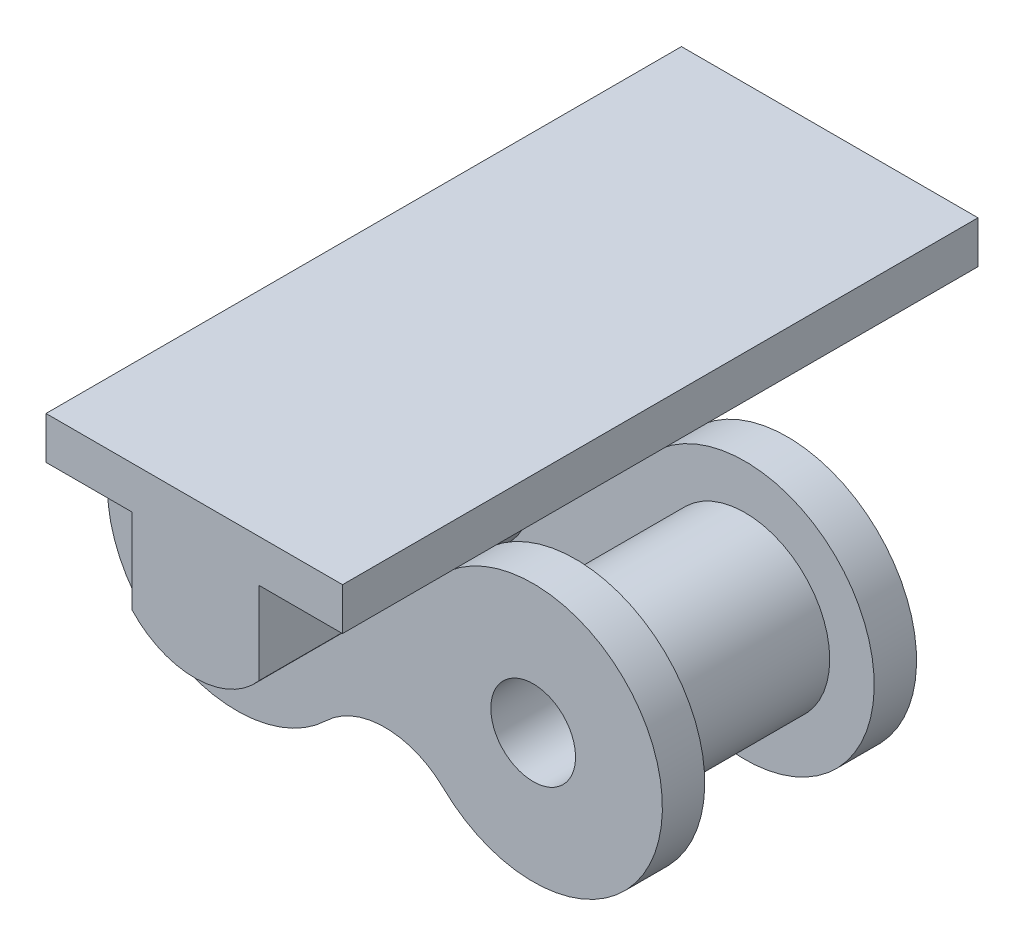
ISO-10303-21;
HEADER;
FILE_DESCRIPTION(('STEP AP214'),'2;1');
FILE_NAME('part.step','',(''),(''),'','','');
FILE_SCHEMA(('AUTOMOTIVE_DESIGN { 1 0 10303 214 1 1 1 1 }'));
ENDSEC;
DATA;
#1=APPLICATION_CONTEXT('core data for automotive mechanical design processes');
#2=APPLICATION_PROTOCOL_DEFINITION('international standard','automotive_design',2000,#1);
#3=PRODUCT_CONTEXT('',#1,'mechanical');
#4=PRODUCT('Part','Part','',(#3));
#5=PRODUCT_RELATED_PRODUCT_CATEGORY('part','',(#4));
#6=PRODUCT_DEFINITION_FORMATION('','',#4);
#7=PRODUCT_DEFINITION_CONTEXT('part definition',#1,'design');
#8=PRODUCT_DEFINITION('design','',#6,#7);
#9=PRODUCT_DEFINITION_SHAPE('','',#8);
#10=(LENGTH_UNIT() NAMED_UNIT(*) SI_UNIT(.MILLI.,.METRE.));
#11=(NAMED_UNIT(*) PLANE_ANGLE_UNIT() SI_UNIT($,.RADIAN.));
#12=(NAMED_UNIT(*) SI_UNIT($,.STERADIAN.) SOLID_ANGLE_UNIT());
#13=UNCERTAINTY_MEASURE_WITH_UNIT(LENGTH_MEASURE(1.E-05),#10,'distance_accuracy_value','');
#14=(GEOMETRIC_REPRESENTATION_CONTEXT(3) GLOBAL_UNCERTAINTY_ASSIGNED_CONTEXT((#13)) GLOBAL_UNIT_ASSIGNED_CONTEXT((#10,
#11,#12)) REPRESENTATION_CONTEXT('',''));
#15=CARTESIAN_POINT('',(0.,0.,0.));
#16=DIRECTION('',(0.,0.,1.));
#17=DIRECTION('',(1.,0.,0.));
#18=AXIS2_PLACEMENT_3D('',#15,#16,#17);
#19=CARTESIAN_POINT('',(3.5,3.64039832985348,2.));
#20=DIRECTION('',(0.,0.,1.));
#21=DIRECTION('',(1.,0.,0.));
#22=AXIS2_PLACEMENT_3D('',#19,#20,#21);
#23=PLANE('',#22);
#24=CARTESIAN_POINT('',(-7.,0.,2.));
#25=DIRECTION('',(0.,0.,1.));
#26=DIRECTION('',(1.,0.,0.));
#27=AXIS2_PLACEMENT_3D('',#24,#25,#26);
#28=CIRCLE('',#27,4.);
#29=CARTESIAN_POINT('',(-3.,0.,2.));
#30=VERTEX_POINT('',#29);
#31=EDGE_CURVE('E307',#30,#30,#28,.T.);
#32=ORIENTED_EDGE('',*,*,#31,.F.);
#33=EDGE_LOOP('',(#32));
#34=FACE_BOUND('',#33,.T.);
#35=CARTESIAN_POINT('',(7.,0.,2.));
#36=DIRECTION('',(0.,0.,1.));
#37=DIRECTION('',(1.,0.,0.));
#38=AXIS2_PLACEMENT_3D('',#35,#36,#37);
#39=CIRCLE('',#38,4.);
#40=CARTESIAN_POINT('',(11.,0.,2.));
#41=VERTEX_POINT('',#40);
#42=EDGE_CURVE('E302',#41,#41,#39,.T.);
#43=ORIENTED_EDGE('',*,*,#42,.F.);
#44=EDGE_LOOP('',(#43));
#45=FACE_BOUND('',#44,.T.);
#46=CARTESIAN_POINT('',(7.,0.,2.));
#47=DIRECTION('',(0.,0.,1.));
#48=DIRECTION('',(-1.,0.,0.));
#49=AXIS2_PLACEMENT_3D('',#46,#47,#48);
#50=CIRCLE('',#49,6.1);
#51=CARTESIAN_POINT('',(2.77227722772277,-4.39731283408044,2.));
#52=VERTEX_POINT('',#51);
#53=CARTESIAN_POINT('',(3.06146360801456,4.65810380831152,2.));
#54=VERTEX_POINT('',#53);
#55=EDGE_CURVE('E334',#52,#54,#50,.T.);
#56=ORIENTED_EDGE('',*,*,#55,.T.);
#57=CARTESIAN_POINT('',(0.0143933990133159,7.24950557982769,2.));
#58=DIRECTION('',(0.,0.,1.));
#59=DIRECTION('',(1.,0.,0.));
#60=AXIS2_PLACEMENT_3D('',#57,#58,#59);
#61=CIRCLE('',#60,4.);
#62=CARTESIAN_POINT('',(-2.93853639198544,4.55131995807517,2.));
#63=VERTEX_POINT('',#62);
#64=EDGE_CURVE('E55',#54,#63,#61,.F.);
#65=ORIENTED_EDGE('',*,*,#64,.T.);
#66=CARTESIAN_POINT('',(-7.,0.,2.));
#67=DIRECTION('',(0.,0.,1.));
#68=DIRECTION('',(1.,0.,0.));
#69=AXIS2_PLACEMENT_3D('',#66,#67,#68);
#70=CIRCLE('',#69,6.1);
#71=CARTESIAN_POINT('',(-2.77227722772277,-4.39731283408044,2.));
#72=VERTEX_POINT('',#71);
#73=EDGE_CURVE('E327',#63,#72,#70,.T.);
#74=ORIENTED_EDGE('',*,*,#73,.T.);
#75=CARTESIAN_POINT('',(0.,-7.28079665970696,2.));
#76=DIRECTION('',(0.,0.,-1.));
#77=DIRECTION('',(-1.,0.,0.));
#78=AXIS2_PLACEMENT_3D('',#75,#76,#77);
#79=CIRCLE('',#78,4.);
#80=EDGE_CURVE('E330',#72,#52,#79,.T.);
#81=ORIENTED_EDGE('',*,*,#80,.T.);
#82=EDGE_LOOP('',(#56,#65,#74,#81));
#83=FACE_BOUND('',#82,.T.);
#84=ADVANCED_FACE('F39',(#34,#45,#83),#23,.T.);
#85=CARTESIAN_POINT('',(3.5,3.64039832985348,0.));
#86=DIRECTION('',(0.,0.,1.));
#87=DIRECTION('',(1.,0.,0.));
#88=AXIS2_PLACEMENT_3D('',#85,#86,#87);
#89=PLANE('',#88);
#90=CARTESIAN_POINT('',(7.,0.,0.));
#91=DIRECTION('',(0.,0.,1.));
#92=DIRECTION('',(-1.,0.,0.));
#93=AXIS2_PLACEMENT_3D('',#90,#91,#92);
#94=CIRCLE('',#93,2.);
#95=CARTESIAN_POINT('',(5.,0.,0.));
#96=VERTEX_POINT('',#95);
#97=EDGE_CURVE('E315',#96,#96,#94,.T.);
#98=ORIENTED_EDGE('',*,*,#97,.T.);
#99=EDGE_LOOP('',(#98));
#100=FACE_BOUND('',#99,.T.);
#101=CARTESIAN_POINT('',(-7.,0.,0.));
#102=DIRECTION('',(0.,0.,1.));
#103=DIRECTION('',(1.,0.,0.));
#104=AXIS2_PLACEMENT_3D('',#101,#102,#103);
#105=CIRCLE('',#104,2.);
#106=CARTESIAN_POINT('',(-5.,0.,0.));
#107=VERTEX_POINT('',#106);
#108=EDGE_CURVE('E322',#107,#107,#105,.T.);
#109=ORIENTED_EDGE('',*,*,#108,.T.);
#110=EDGE_LOOP('',(#109));
#111=FACE_BOUND('',#110,.T.);
#112=CARTESIAN_POINT('',(0.0143933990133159,7.24950557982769,0.));
#113=DIRECTION('',(0.,0.,1.));
#114=DIRECTION('',(1.,0.,0.));
#115=AXIS2_PLACEMENT_3D('',#112,#113,#114);
#116=CIRCLE('',#115,4.);
#117=CARTESIAN_POINT('',(3.06146360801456,4.65810380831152,0.));
#118=VERTEX_POINT('',#117);
#119=CARTESIAN_POINT('',(-2.93853639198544,4.55131995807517,0.));
#120=VERTEX_POINT('',#119);
#121=EDGE_CURVE('E261',#118,#120,#116,.F.);
#122=ORIENTED_EDGE('',*,*,#121,.F.);
#123=CARTESIAN_POINT('',(7.,0.,0.));
#124=DIRECTION('',(0.,0.,1.));
#125=DIRECTION('',(-1.,0.,0.));
#126=AXIS2_PLACEMENT_3D('',#123,#124,#125);
#127=CIRCLE('',#126,6.1);
#128=CARTESIAN_POINT('',(2.77227722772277,-4.39731283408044,0.));
#129=VERTEX_POINT('',#128);
#130=EDGE_CURVE('E331',#129,#118,#127,.T.);
#131=ORIENTED_EDGE('',*,*,#130,.F.);
#132=CARTESIAN_POINT('',(0.,-7.28079665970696,0.));
#133=DIRECTION('',(0.,0.,-1.));
#134=DIRECTION('',(-1.,0.,0.));
#135=AXIS2_PLACEMENT_3D('',#132,#133,#134);
#136=CIRCLE('',#135,4.);
#137=CARTESIAN_POINT('',(-2.77227722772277,-4.39731283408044,0.));
#138=VERTEX_POINT('',#137);
#139=EDGE_CURVE('E340',#138,#129,#136,.T.);
#140=ORIENTED_EDGE('',*,*,#139,.F.);
#141=CARTESIAN_POINT('',(-7.,0.,0.));
#142=DIRECTION('',(0.,0.,1.));
#143=DIRECTION('',(1.,0.,0.));
#144=AXIS2_PLACEMENT_3D('',#141,#142,#143);
#145=CIRCLE('',#144,6.1);
#146=EDGE_CURVE('E326',#120,#138,#145,.T.);
#147=ORIENTED_EDGE('',*,*,#146,.F.);
#148=EDGE_LOOP('',(#122,#131,#140,#147));
#149=FACE_BOUND('',#148,.T.);
#150=ADVANCED_FACE('F358',(#100,#111,#149),#89,.F.);
#151=CARTESIAN_POINT('',(-7.,0.,2.));
#152=DIRECTION('',(0.,0.,-1.));
#153=DIRECTION('',(-1.,0.,0.));
#154=AXIS2_PLACEMENT_3D('',#151,#152,#153);
#155=CYLINDRICAL_SURFACE('',#154,6.1);
#156=DIRECTION('',(0.,0.,-1.));
#157=VECTOR('',#156,1.);
#158=CARTESIAN_POINT('',(-2.93853639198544,4.55131995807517,21.));
#159=LINE('',#158,#157);
#160=EDGE_CURVE('E62',#63,#120,#159,.T.);
#161=ORIENTED_EDGE('',*,*,#160,.T.);
#162=ORIENTED_EDGE('',*,*,#146,.T.);
#163=DIRECTION('',(0.,0.,-1.));
#164=VECTOR('',#163,1.);
#165=CARTESIAN_POINT('',(-2.77227722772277,-4.39731283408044,2.));
#166=LINE('',#165,#164);
#167=EDGE_CURVE('E48',#72,#138,#166,.T.);
#168=ORIENTED_EDGE('',*,*,#167,.F.);
#169=ORIENTED_EDGE('',*,*,#73,.F.);
#170=EDGE_LOOP('',(#161,#162,#168,#169));
#171=FACE_BOUND('',#170,.T.);
#172=ADVANCED_FACE('F41',(#171),#155,.T.);
#173=CARTESIAN_POINT('',(7.,0.,2.));
#174=DIRECTION('',(0.,0.,-1.));
#175=DIRECTION('',(-1.,0.,0.));
#176=AXIS2_PLACEMENT_3D('',#173,#174,#175);
#177=CYLINDRICAL_SURFACE('',#176,6.1);
#178=DIRECTION('',(0.,0.,-1.));
#179=VECTOR('',#178,1.);
#180=CARTESIAN_POINT('',(3.06146360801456,4.65810380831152,21.));
#181=LINE('',#180,#179);
#182=EDGE_CURVE('E162',#54,#118,#181,.T.);
#183=ORIENTED_EDGE('',*,*,#182,.F.);
#184=ORIENTED_EDGE('',*,*,#55,.F.);
#185=DIRECTION('',(0.,0.,-1.));
#186=VECTOR('',#185,1.);
#187=CARTESIAN_POINT('',(2.77227722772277,-4.39731283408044,2.));
#188=LINE('',#187,#186);
#189=EDGE_CURVE('E337',#52,#129,#188,.T.);
#190=ORIENTED_EDGE('',*,*,#189,.T.);
#191=ORIENTED_EDGE('',*,*,#130,.T.);
#192=EDGE_LOOP('',(#183,#184,#190,#191));
#193=FACE_BOUND('',#192,.T.);
#194=ADVANCED_FACE('F360',(#193),#177,.T.);
#195=CARTESIAN_POINT('',(7.,0.,10.));
#196=DIRECTION('',(0.,0.,1.));
#197=DIRECTION('',(1.,0.,0.));
#198=AXIS2_PLACEMENT_3D('',#195,#196,#197);
#199=CYLINDRICAL_SURFACE('',#198,6.1);
#200=CARTESIAN_POINT('',(7.,0.,10.));
#201=DIRECTION('',(0.,0.,1.));
#202=DIRECTION('',(-1.,0.,0.));
#203=AXIS2_PLACEMENT_3D('',#200,#201,#202);
#204=CIRCLE('',#203,6.1);
#205=CARTESIAN_POINT('',(2.77227722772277,-4.39731283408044,10.));
#206=VERTEX_POINT('',#205);
#207=CARTESIAN_POINT('',(3.06146360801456,4.65810380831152,10.));
#208=VERTEX_POINT('',#207);
#209=EDGE_CURVE('E275',#206,#208,#204,.T.);
#210=ORIENTED_EDGE('',*,*,#209,.T.);
#211=CARTESIAN_POINT('',(3.06146360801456,4.65810380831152,12.));
#212=VERTEX_POINT('',#211);
#213=EDGE_CURVE('E258',#212,#208,#181,.T.);
#214=ORIENTED_EDGE('',*,*,#213,.F.);
#215=CARTESIAN_POINT('',(7.,0.,12.));
#216=DIRECTION('',(0.,0.,1.));
#217=DIRECTION('',(-1.,0.,0.));
#218=AXIS2_PLACEMENT_3D('',#215,#216,#217);
#219=CIRCLE('',#218,6.1);
#220=CARTESIAN_POINT('',(2.77227722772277,-4.39731283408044,12.));
#221=VERTEX_POINT('',#220);
#222=EDGE_CURVE('E274',#221,#212,#219,.T.);
#223=ORIENTED_EDGE('',*,*,#222,.F.);
#224=DIRECTION('',(0.,0.,1.));
#225=VECTOR('',#224,1.);
#226=CARTESIAN_POINT('',(2.77227722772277,-4.39731283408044,10.));
#227=LINE('',#226,#225);
#228=EDGE_CURVE('E299',#206,#221,#227,.T.);
#229=ORIENTED_EDGE('',*,*,#228,.F.);
#230=EDGE_LOOP('',(#210,#214,#223,#229));
#231=FACE_BOUND('',#230,.T.);
#232=ADVANCED_FACE('F426',(#231),#199,.T.);
#233=CARTESIAN_POINT('',(-7.,0.,10.));
#234=DIRECTION('',(0.,0.,1.));
#235=DIRECTION('',(1.,0.,0.));
#236=AXIS2_PLACEMENT_3D('',#233,#234,#235);
#237=CYLINDRICAL_SURFACE('',#236,6.1);
#238=CARTESIAN_POINT('',(-7.,0.,12.));
#239=DIRECTION('',(0.,0.,1.));
#240=DIRECTION('',(1.,0.,0.));
#241=AXIS2_PLACEMENT_3D('',#238,#239,#240);
#242=CIRCLE('',#241,6.1);
#243=CARTESIAN_POINT('',(-2.93853639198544,4.55131995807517,12.));
#244=VERTEX_POINT('',#243);
#245=CARTESIAN_POINT('',(-2.77227722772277,-4.39731283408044,12.));
#246=VERTEX_POINT('',#245);
#247=EDGE_CURVE('E280',#244,#246,#242,.T.);
#248=ORIENTED_EDGE('',*,*,#247,.F.);
#249=CARTESIAN_POINT('',(-2.93853639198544,4.55131995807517,10.));
#250=VERTEX_POINT('',#249);
#251=EDGE_CURVE('E239',#244,#250,#159,.T.);
#252=ORIENTED_EDGE('',*,*,#251,.T.);
#253=CARTESIAN_POINT('',(-7.,0.,10.));
#254=DIRECTION('',(0.,0.,1.));
#255=DIRECTION('',(1.,0.,0.));
#256=AXIS2_PLACEMENT_3D('',#253,#254,#255);
#257=CIRCLE('',#256,6.1);
#258=CARTESIAN_POINT('',(-2.77227722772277,-4.39731283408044,10.));
#259=VERTEX_POINT('',#258);
#260=EDGE_CURVE('E284',#250,#259,#257,.T.);
#261=ORIENTED_EDGE('',*,*,#260,.T.);
#262=DIRECTION('',(0.,0.,1.));
#263=VECTOR('',#262,1.);
#264=CARTESIAN_POINT('',(-2.77227722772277,-4.39731283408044,10.));
#265=LINE('',#264,#263);
#266=EDGE_CURVE('E287',#259,#246,#265,.T.);
#267=ORIENTED_EDGE('',*,*,#266,.T.);
#268=EDGE_LOOP('',(#248,#252,#261,#267));
#269=FACE_BOUND('',#268,.T.);
#270=ADVANCED_FACE('F383',(#269),#237,.T.);
#271=CARTESIAN_POINT('',(3.5,3.64039832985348,10.));
#272=DIRECTION('',(0.,0.,-1.));
#273=DIRECTION('',(1.,0.,0.));
#274=AXIS2_PLACEMENT_3D('',#271,#272,#273);
#275=PLANE('',#274);
#276=CARTESIAN_POINT('',(-7.,0.,10.));
#277=DIRECTION('',(0.,0.,1.));
#278=DIRECTION('',(1.,0.,0.));
#279=AXIS2_PLACEMENT_3D('',#276,#277,#278);
#280=CIRCLE('',#279,4.);
#281=CARTESIAN_POINT('',(-3.,0.,10.));
#282=VERTEX_POINT('',#281);
#283=EDGE_CURVE('E311',#282,#282,#280,.T.);
#284=ORIENTED_EDGE('',*,*,#283,.T.);
#285=EDGE_LOOP('',(#284));
#286=FACE_BOUND('',#285,.T.);
#287=CARTESIAN_POINT('',(7.,0.,10.));
#288=DIRECTION('',(0.,0.,1.));
#289=DIRECTION('',(1.,0.,0.));
#290=AXIS2_PLACEMENT_3D('',#287,#288,#289);
#291=CIRCLE('',#290,4.);
#292=CARTESIAN_POINT('',(11.,0.,10.));
#293=VERTEX_POINT('',#292);
#294=EDGE_CURVE('E303',#293,#293,#291,.T.);
#295=ORIENTED_EDGE('',*,*,#294,.T.);
#296=EDGE_LOOP('',(#295));
#297=FACE_BOUND('',#296,.T.);
#298=ORIENTED_EDGE('',*,*,#260,.F.);
#299=CARTESIAN_POINT('',(0.0143933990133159,7.24950557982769,10.));
#300=DIRECTION('',(0.,0.,-1.));
#301=DIRECTION('',(-1.,0.,0.));
#302=AXIS2_PLACEMENT_3D('',#299,#300,#301);
#303=CIRCLE('',#302,4.);
#304=EDGE_CURVE('E257',#250,#208,#303,.F.);
#305=ORIENTED_EDGE('',*,*,#304,.T.);
#306=ORIENTED_EDGE('',*,*,#209,.F.);
#307=CARTESIAN_POINT('',(0.,-7.28079665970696,10.));
#308=DIRECTION('',(0.,0.,-1.));
#309=DIRECTION('',(-1.,0.,0.));
#310=AXIS2_PLACEMENT_3D('',#307,#308,#309);
#311=CIRCLE('',#310,4.);
#312=EDGE_CURVE('E279',#259,#206,#311,.T.);
#313=ORIENTED_EDGE('',*,*,#312,.F.);
#314=EDGE_LOOP('',(#298,#305,#306,#313));
#315=FACE_BOUND('',#314,.T.);
#316=ADVANCED_FACE('F389',(#286,#297,#315),#275,.T.);
#317=CARTESIAN_POINT('',(3.5,3.64039832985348,12.));
#318=DIRECTION('',(0.,0.,-1.));
#319=DIRECTION('',(1.,0.,0.));
#320=AXIS2_PLACEMENT_3D('',#317,#318,#319);
#321=PLANE('',#320);
#322=CARTESIAN_POINT('',(-7.,0.,12.));
#323=DIRECTION('',(0.,0.,1.));
#324=DIRECTION('',(1.,0.,0.));
#325=AXIS2_PLACEMENT_3D('',#322,#323,#324);
#326=CIRCLE('',#325,2.);
#327=CARTESIAN_POINT('',(-5.,0.,12.));
#328=VERTEX_POINT('',#327);
#329=EDGE_CURVE('E270',#328,#328,#326,.T.);
#330=ORIENTED_EDGE('',*,*,#329,.F.);
#331=EDGE_LOOP('',(#330));
#332=FACE_BOUND('',#331,.T.);
#333=CARTESIAN_POINT('',(7.,0.,12.));
#334=DIRECTION('',(0.,0.,1.));
#335=DIRECTION('',(-1.,0.,0.));
#336=AXIS2_PLACEMENT_3D('',#333,#334,#335);
#337=CIRCLE('',#336,2.);
#338=CARTESIAN_POINT('',(5.,0.,12.));
#339=VERTEX_POINT('',#338);
#340=EDGE_CURVE('E266',#339,#339,#337,.T.);
#341=ORIENTED_EDGE('',*,*,#340,.F.);
#342=EDGE_LOOP('',(#341));
#343=FACE_BOUND('',#342,.T.);
#344=CARTESIAN_POINT('',(0.0143933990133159,7.24950557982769,12.));
#345=DIRECTION('',(0.,0.,-1.));
#346=DIRECTION('',(-1.,0.,0.));
#347=AXIS2_PLACEMENT_3D('',#344,#345,#346);
#348=CIRCLE('',#347,4.);
#349=EDGE_CURVE('E11',#244,#212,#348,.F.);
#350=ORIENTED_EDGE('',*,*,#349,.F.);
#351=ORIENTED_EDGE('',*,*,#247,.T.);
#352=CARTESIAN_POINT('',(0.,-7.28079665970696,12.));
#353=DIRECTION('',(0.,0.,-1.));
#354=DIRECTION('',(-1.,0.,0.));
#355=AXIS2_PLACEMENT_3D('',#352,#353,#354);
#356=CIRCLE('',#355,4.);
#357=EDGE_CURVE('E290',#246,#221,#356,.T.);
#358=ORIENTED_EDGE('',*,*,#357,.T.);
#359=ORIENTED_EDGE('',*,*,#222,.T.);
#360=EDGE_LOOP('',(#350,#351,#358,#359));
#361=FACE_BOUND('',#360,.T.);
#362=ADVANCED_FACE('F422',(#332,#343,#361),#321,.F.);
#363=CARTESIAN_POINT('',(0.,-7.28079665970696,2.));
#364=DIRECTION('',(0.,0.,-1.));
#365=DIRECTION('',(-1.,0.,0.));
#366=AXIS2_PLACEMENT_3D('',#363,#364,#365);
#367=CYLINDRICAL_SURFACE('',#366,4.);
#368=ORIENTED_EDGE('',*,*,#139,.T.);
#369=ORIENTED_EDGE('',*,*,#189,.F.);
#370=ORIENTED_EDGE('',*,*,#80,.F.);
#371=ORIENTED_EDGE('',*,*,#167,.T.);
#372=EDGE_LOOP('',(#368,#369,#370,#371));
#373=FACE_BOUND('',#372,.T.);
#374=ADVANCED_FACE('F353',(#373),#367,.F.);
#375=CARTESIAN_POINT('',(-7.,0.,2.));
#376=DIRECTION('',(0.,0.,-1.));
#377=DIRECTION('',(-1.,0.,0.));
#378=AXIS2_PLACEMENT_3D('',#375,#376,#377);
#379=CYLINDRICAL_SURFACE('',#378,2.);
#380=ORIENTED_EDGE('',*,*,#108,.F.);
#381=EDGE_LOOP('',(#380));
#382=FACE_BOUND('',#381,.T.);
#383=ORIENTED_EDGE('',*,*,#329,.T.);
#384=EDGE_LOOP('',(#383));
#385=FACE_BOUND('',#384,.T.);
#386=ADVANCED_FACE('F453',(#382,#385),#379,.F.);
#387=CARTESIAN_POINT('',(7.,0.,2.));
#388=DIRECTION('',(0.,0.,-1.));
#389=DIRECTION('',(-1.,0.,0.));
#390=AXIS2_PLACEMENT_3D('',#387,#388,#389);
#391=CYLINDRICAL_SURFACE('',#390,2.);
#392=ORIENTED_EDGE('',*,*,#97,.F.);
#393=EDGE_LOOP('',(#392));
#394=FACE_BOUND('',#393,.T.);
#395=ORIENTED_EDGE('',*,*,#340,.T.);
#396=EDGE_LOOP('',(#395));
#397=FACE_BOUND('',#396,.T.);
#398=ADVANCED_FACE('F462',(#394,#397),#391,.F.);
#399=CARTESIAN_POINT('',(-7.,0.,10.));
#400=DIRECTION('',(0.,0.,-1.));
#401=DIRECTION('',(-1.,0.,0.));
#402=AXIS2_PLACEMENT_3D('',#399,#400,#401);
#403=CYLINDRICAL_SURFACE('',#402,4.);
#404=ORIENTED_EDGE('',*,*,#283,.F.);
#405=EDGE_LOOP('',(#404));
#406=FACE_BOUND('',#405,.T.);
#407=ORIENTED_EDGE('',*,*,#31,.T.);
#408=EDGE_LOOP('',(#407));
#409=FACE_BOUND('',#408,.T.);
#410=ADVANCED_FACE('F437',(#406,#409),#403,.T.);
#411=CARTESIAN_POINT('',(7.,0.,10.));
#412=DIRECTION('',(0.,0.,-1.));
#413=DIRECTION('',(-1.,0.,0.));
#414=AXIS2_PLACEMENT_3D('',#411,#412,#413);
#415=CYLINDRICAL_SURFACE('',#414,4.);
#416=ORIENTED_EDGE('',*,*,#294,.F.);
#417=EDGE_LOOP('',(#416));
#418=FACE_BOUND('',#417,.T.);
#419=ORIENTED_EDGE('',*,*,#42,.T.);
#420=EDGE_LOOP('',(#419));
#421=FACE_BOUND('',#420,.T.);
#422=ADVANCED_FACE('F430',(#418,#421),#415,.T.);
#423=CARTESIAN_POINT('',(0.,-7.28079665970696,10.));
#424=DIRECTION('',(0.,0.,1.));
#425=DIRECTION('',(1.,0.,0.));
#426=AXIS2_PLACEMENT_3D('',#423,#424,#425);
#427=CYLINDRICAL_SURFACE('',#426,4.);
#428=ORIENTED_EDGE('',*,*,#357,.F.);
#429=ORIENTED_EDGE('',*,*,#266,.F.);
#430=ORIENTED_EDGE('',*,*,#312,.T.);
#431=ORIENTED_EDGE('',*,*,#228,.T.);
#432=EDGE_LOOP('',(#428,#429,#430,#431));
#433=FACE_BOUND('',#432,.T.);
#434=ADVANCED_FACE('F428',(#433),#427,.F.);
#435=CARTESIAN_POINT('',(0.0143933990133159,7.24950557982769,21.));
#436=DIRECTION('',(0.,0.,-1.));
#437=DIRECTION('',(-1.,0.,0.));
#438=AXIS2_PLACEMENT_3D('',#435,#436,#437);
#439=CYLINDRICAL_SURFACE('',#438,4.);
#440=CARTESIAN_POINT('',(3.06146360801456,4.65810380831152,-9.));
#441=VERTEX_POINT('',#440);
#442=EDGE_CURVE('E155',#118,#441,#181,.T.);
#443=ORIENTED_EDGE('',*,*,#442,.F.);
#444=ORIENTED_EDGE('',*,*,#121,.T.);
#445=CARTESIAN_POINT('',(-2.93853639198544,4.55131995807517,-9.));
#446=VERTEX_POINT('',#445);
#447=EDGE_CURVE('E184',#120,#446,#159,.T.);
#448=ORIENTED_EDGE('',*,*,#447,.T.);
#449=CARTESIAN_POINT('',(0.0143933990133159,7.24950557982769,-9.));
#450=DIRECTION('',(0.,0.,1.));
#451=DIRECTION('',(1.,0.,0.));
#452=AXIS2_PLACEMENT_3D('',#449,#450,#451);
#453=CIRCLE('',#452,4.);
#454=EDGE_CURVE('E175',#446,#441,#453,.T.);
#455=ORIENTED_EDGE('',*,*,#454,.T.);
#456=EDGE_LOOP('',(#443,#444,#448,#455));
#457=FACE_BOUND('',#456,.T.);
#458=ADVANCED_FACE('F182',(#457),#439,.T.);
#459=CARTESIAN_POINT('',(-2.93853639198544,4.55131995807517,21.));
#460=VERTEX_POINT('',#459);
#461=EDGE_CURVE('E234',#460,#244,#159,.T.);
#462=ORIENTED_EDGE('',*,*,#461,.T.);
#463=ORIENTED_EDGE('',*,*,#349,.T.);
#464=CARTESIAN_POINT('',(3.06146360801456,4.65810380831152,21.));
#465=VERTEX_POINT('',#464);
#466=EDGE_CURVE('E169',#465,#212,#181,.T.);
#467=ORIENTED_EDGE('',*,*,#466,.F.);
#468=CARTESIAN_POINT('',(0.0143933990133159,7.24950557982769,21.));
#469=DIRECTION('',(0.,0.,1.));
#470=DIRECTION('',(1.,0.,0.));
#471=AXIS2_PLACEMENT_3D('',#468,#469,#470);
#472=CIRCLE('',#471,4.);
#473=EDGE_CURVE('E209',#460,#465,#472,.T.);
#474=ORIENTED_EDGE('',*,*,#473,.F.);
#475=EDGE_LOOP('',(#462,#463,#467,#474));
#476=FACE_BOUND('',#475,.T.);
#477=ADVANCED_FACE('F420',(#476),#439,.T.);
#478=ORIENTED_EDGE('',*,*,#64,.F.);
#479=EDGE_CURVE('E367',#208,#54,#181,.T.);
#480=ORIENTED_EDGE('',*,*,#479,.F.);
#481=ORIENTED_EDGE('',*,*,#304,.F.);
#482=EDGE_CURVE('E370',#250,#63,#159,.T.);
#483=ORIENTED_EDGE('',*,*,#482,.T.);
#484=EDGE_LOOP('',(#478,#480,#481,#483));
#485=FACE_BOUND('',#484,.T.);
#486=ADVANCED_FACE('F365',(#485),#439,.T.);
#487=CARTESIAN_POINT('',(3.06146360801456,4.65810380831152,21.));
#488=DIRECTION('',(-1.,0.,0.));
#489=DIRECTION('',(0.,0.,1.));
#490=AXIS2_PLACEMENT_3D('',#487,#488,#489);
#491=PLANE('',#490);
#492=ORIENTED_EDGE('',*,*,#466,.T.);
#493=ORIENTED_EDGE('',*,*,#213,.T.);
#494=ORIENTED_EDGE('',*,*,#479,.T.);
#495=ORIENTED_EDGE('',*,*,#182,.T.);
#496=ORIENTED_EDGE('',*,*,#442,.T.);
#497=DIRECTION('',(0.,1.,0.));
#498=VECTOR('',#497,1.);
#499=CARTESIAN_POINT('',(3.06146360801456,4.65810380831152,-9.));
#500=LINE('',#499,#498);
#501=CARTESIAN_POINT('',(3.06146360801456,8.55131995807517,-9.));
#502=VERTEX_POINT('',#501);
#503=EDGE_CURVE('E160',#441,#502,#500,.T.);
#504=ORIENTED_EDGE('',*,*,#503,.T.);
#505=DIRECTION('',(0.,0.,-1.));
#506=VECTOR('',#505,1.);
#507=CARTESIAN_POINT('',(3.06146360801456,8.55131995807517,21.));
#508=LINE('',#507,#506);
#509=CARTESIAN_POINT('',(3.06146360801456,8.55131995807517,21.));
#510=VERTEX_POINT('',#509);
#511=EDGE_CURVE('E167',#510,#502,#508,.T.);
#512=ORIENTED_EDGE('',*,*,#511,.F.);
#513=DIRECTION('',(0.,1.,0.));
#514=VECTOR('',#513,1.);
#515=CARTESIAN_POINT('',(3.06146360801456,4.65810380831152,21.));
#516=LINE('',#515,#514);
#517=EDGE_CURVE('E213',#465,#510,#516,.T.);
#518=ORIENTED_EDGE('',*,*,#517,.F.);
#519=EDGE_LOOP('',(#492,#493,#494,#495,#496,#504,#512,#518));
#520=FACE_BOUND('',#519,.T.);
#521=ADVANCED_FACE('F158',(#520),#491,.F.);
#522=CARTESIAN_POINT('',(3.06146360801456,8.55131995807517,21.));
#523=DIRECTION('',(0.,1.,0.));
#524=DIRECTION('',(0.,0.,1.));
#525=AXIS2_PLACEMENT_3D('',#522,#523,#524);
#526=PLANE('',#525);
#527=ORIENTED_EDGE('',*,*,#511,.T.);
#528=DIRECTION('',(1.,0.,0.));
#529=VECTOR('',#528,1.);
#530=CARTESIAN_POINT('',(3.06146360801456,8.55131995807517,-9.));
#531=LINE('',#530,#529);
#532=CARTESIAN_POINT('',(7.,8.55131995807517,-9.));
#533=VERTEX_POINT('',#532);
#534=EDGE_CURVE('E179',#502,#533,#531,.T.);
#535=ORIENTED_EDGE('',*,*,#534,.T.);
#536=DIRECTION('',(0.,0.,-1.));
#537=VECTOR('',#536,1.);
#538=CARTESIAN_POINT('',(7.,8.55131995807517,21.));
#539=LINE('',#538,#537);
#540=CARTESIAN_POINT('',(7.,8.55131995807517,21.));
#541=VERTEX_POINT('',#540);
#542=EDGE_CURVE('E251',#541,#533,#539,.T.);
#543=ORIENTED_EDGE('',*,*,#542,.F.);
#544=DIRECTION('',(1.,0.,0.));
#545=VECTOR('',#544,1.);
#546=CARTESIAN_POINT('',(3.06146360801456,8.55131995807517,21.));
#547=LINE('',#546,#545);
#548=EDGE_CURVE('E216',#510,#541,#547,.T.);
#549=ORIENTED_EDGE('',*,*,#548,.F.);
#550=EDGE_LOOP('',(#527,#535,#543,#549));
#551=FACE_BOUND('',#550,.T.);
#552=ADVANCED_FACE('F414',(#551),#526,.F.);
#553=CARTESIAN_POINT('',(7.,8.55131995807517,21.));
#554=DIRECTION('',(-1.,0.,0.));
#555=DIRECTION('',(0.,0.,1.));
#556=AXIS2_PLACEMENT_3D('',#553,#554,#555);
#557=PLANE('',#556);
#558=ORIENTED_EDGE('',*,*,#542,.T.);
#559=DIRECTION('',(0.,1.,0.));
#560=VECTOR('',#559,1.);
#561=CARTESIAN_POINT('',(7.,8.55131995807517,-9.));
#562=LINE('',#561,#560);
#563=CARTESIAN_POINT('',(7.,10.5513199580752,-9.));
#564=VERTEX_POINT('',#563);
#565=EDGE_CURVE('E190',#533,#564,#562,.T.);
#566=ORIENTED_EDGE('',*,*,#565,.T.);
#567=DIRECTION('',(0.,0.,-1.));
#568=VECTOR('',#567,1.);
#569=CARTESIAN_POINT('',(7.,10.5513199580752,21.));
#570=LINE('',#569,#568);
#571=CARTESIAN_POINT('',(7.,10.5513199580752,21.));
#572=VERTEX_POINT('',#571);
#573=EDGE_CURVE('E248',#572,#564,#570,.T.);
#574=ORIENTED_EDGE('',*,*,#573,.F.);
#575=DIRECTION('',(0.,1.,0.));
#576=VECTOR('',#575,1.);
#577=CARTESIAN_POINT('',(7.,8.55131995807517,21.));
#578=LINE('',#577,#576);
#579=EDGE_CURVE('E219',#541,#572,#578,.T.);
#580=ORIENTED_EDGE('',*,*,#579,.F.);
#581=EDGE_LOOP('',(#558,#566,#574,#580));
#582=FACE_BOUND('',#581,.T.);
#583=ADVANCED_FACE('F409',(#582),#557,.F.);
#584=CARTESIAN_POINT('',(-7.,10.5513199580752,21.));
#585=DIRECTION('',(0.,-1.,0.));
#586=DIRECTION('',(0.,0.,-1.));
#587=AXIS2_PLACEMENT_3D('',#584,#585,#586);
#588=PLANE('',#587);
#589=ORIENTED_EDGE('',*,*,#573,.T.);
#590=DIRECTION('',(-1.,0.,0.));
#591=VECTOR('',#590,1.);
#592=CARTESIAN_POINT('',(-7.,10.5513199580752,-9.));
#593=LINE('',#592,#591);
#594=CARTESIAN_POINT('',(-7.,10.5513199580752,-9.));
#595=VERTEX_POINT('',#594);
#596=EDGE_CURVE('E194',#564,#595,#593,.T.);
#597=ORIENTED_EDGE('',*,*,#596,.T.);
#598=DIRECTION('',(0.,0.,-1.));
#599=VECTOR('',#598,1.);
#600=CARTESIAN_POINT('',(-7.,10.5513199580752,21.));
#601=LINE('',#600,#599);
#602=CARTESIAN_POINT('',(-7.,10.5513199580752,21.));
#603=VERTEX_POINT('',#602);
#604=EDGE_CURVE('E245',#603,#595,#601,.T.);
#605=ORIENTED_EDGE('',*,*,#604,.F.);
#606=DIRECTION('',(-1.,0.,0.));
#607=VECTOR('',#606,1.);
#608=CARTESIAN_POINT('',(-7.,10.5513199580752,21.));
#609=LINE('',#608,#607);
#610=EDGE_CURVE('E222',#572,#603,#609,.T.);
#611=ORIENTED_EDGE('',*,*,#610,.F.);
#612=EDGE_LOOP('',(#589,#597,#605,#611));
#613=FACE_BOUND('',#612,.T.);
#614=ADVANCED_FACE('F406',(#613),#588,.F.);
#615=CARTESIAN_POINT('',(-7.,8.55131995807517,21.));
#616=DIRECTION('',(1.,0.,0.));
#617=DIRECTION('',(0.,0.,-1.));
#618=AXIS2_PLACEMENT_3D('',#615,#616,#617);
#619=PLANE('',#618);
#620=ORIENTED_EDGE('',*,*,#604,.T.);
#621=DIRECTION('',(0.,-1.,0.));
#622=VECTOR('',#621,1.);
#623=CARTESIAN_POINT('',(-7.,8.55131995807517,-9.));
#624=LINE('',#623,#622);
#625=CARTESIAN_POINT('',(-7.,8.55131995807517,-9.));
#626=VERTEX_POINT('',#625);
#627=EDGE_CURVE('E198',#595,#626,#624,.T.);
#628=ORIENTED_EDGE('',*,*,#627,.T.);
#629=DIRECTION('',(0.,0.,-1.));
#630=VECTOR('',#629,1.);
#631=CARTESIAN_POINT('',(-7.,8.55131995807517,21.));
#632=LINE('',#631,#630);
#633=CARTESIAN_POINT('',(-7.,8.55131995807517,21.));
#634=VERTEX_POINT('',#633);
#635=EDGE_CURVE('E242',#634,#626,#632,.T.);
#636=ORIENTED_EDGE('',*,*,#635,.F.);
#637=DIRECTION('',(0.,-1.,0.));
#638=VECTOR('',#637,1.);
#639=CARTESIAN_POINT('',(-7.,8.55131995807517,21.));
#640=LINE('',#639,#638);
#641=EDGE_CURVE('E225',#603,#634,#640,.T.);
#642=ORIENTED_EDGE('',*,*,#641,.F.);
#643=EDGE_LOOP('',(#620,#628,#636,#642));
#644=FACE_BOUND('',#643,.T.);
#645=ADVANCED_FACE('F400',(#644),#619,.F.);
#646=CARTESIAN_POINT('',(-7.,8.55131995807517,21.));
#647=DIRECTION('',(0.,1.,0.));
#648=DIRECTION('',(0.,0.,1.));
#649=AXIS2_PLACEMENT_3D('',#646,#647,#648);
#650=PLANE('',#649);
#651=ORIENTED_EDGE('',*,*,#635,.T.);
#652=DIRECTION('',(1.,0.,0.));
#653=VECTOR('',#652,1.);
#654=CARTESIAN_POINT('',(-7.,8.55131995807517,-9.));
#655=LINE('',#654,#653);
#656=CARTESIAN_POINT('',(-2.93853639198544,8.55131995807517,-9.));
#657=VERTEX_POINT('',#656);
#658=EDGE_CURVE('E202',#626,#657,#655,.T.);
#659=ORIENTED_EDGE('',*,*,#658,.T.);
#660=DIRECTION('',(0.,0.,-1.));
#661=VECTOR('',#660,1.);
#662=CARTESIAN_POINT('',(-2.93853639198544,8.55131995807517,21.));
#663=LINE('',#662,#661);
#664=CARTESIAN_POINT('',(-2.93853639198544,8.55131995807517,21.));
#665=VERTEX_POINT('',#664);
#666=EDGE_CURVE('E238',#665,#657,#663,.T.);
#667=ORIENTED_EDGE('',*,*,#666,.F.);
#668=DIRECTION('',(1.,0.,0.));
#669=VECTOR('',#668,1.);
#670=CARTESIAN_POINT('',(-7.,8.55131995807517,21.));
#671=LINE('',#670,#669);
#672=EDGE_CURVE('E228',#634,#665,#671,.T.);
#673=ORIENTED_EDGE('',*,*,#672,.F.);
#674=EDGE_LOOP('',(#651,#659,#667,#673));
#675=FACE_BOUND('',#674,.T.);
#676=ADVANCED_FACE('F612',(#675),#650,.F.);
#677=CARTESIAN_POINT('',(-2.93853639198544,4.55131995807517,21.));
#678=DIRECTION('',(1.,0.,0.));
#679=DIRECTION('',(0.,0.,-1.));
#680=AXIS2_PLACEMENT_3D('',#677,#678,#679);
#681=PLANE('',#680);
#682=ORIENTED_EDGE('',*,*,#666,.T.);
#683=DIRECTION('',(0.,-1.,0.));
#684=VECTOR('',#683,1.);
#685=CARTESIAN_POINT('',(-2.93853639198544,4.55131995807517,-9.));
#686=LINE('',#685,#684);
#687=EDGE_CURVE('E206',#657,#446,#686,.T.);
#688=ORIENTED_EDGE('',*,*,#687,.T.);
#689=ORIENTED_EDGE('',*,*,#447,.F.);
#690=ORIENTED_EDGE('',*,*,#160,.F.);
#691=ORIENTED_EDGE('',*,*,#482,.F.);
#692=ORIENTED_EDGE('',*,*,#251,.F.);
#693=ORIENTED_EDGE('',*,*,#461,.F.);
#694=DIRECTION('',(0.,-1.,0.));
#695=VECTOR('',#694,1.);
#696=CARTESIAN_POINT('',(-2.93853639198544,4.55131995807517,21.));
#697=LINE('',#696,#695);
#698=EDGE_CURVE('E231',#665,#460,#697,.T.);
#699=ORIENTED_EDGE('',*,*,#698,.F.);
#700=EDGE_LOOP('',(#682,#688,#689,#690,#691,#692,#693,#699));
#701=FACE_BOUND('',#700,.T.);
#702=ADVANCED_FACE('F391',(#701),#681,.F.);
#703=CARTESIAN_POINT('',(0.0143933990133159,7.24950557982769,21.));
#704=DIRECTION('',(0.,0.,1.));
#705=DIRECTION('',(1.,0.,0.));
#706=AXIS2_PLACEMENT_3D('',#703,#704,#705);
#707=PLANE('',#706);
#708=ORIENTED_EDGE('',*,*,#473,.T.);
#709=ORIENTED_EDGE('',*,*,#517,.T.);
#710=ORIENTED_EDGE('',*,*,#548,.T.);
#711=ORIENTED_EDGE('',*,*,#579,.T.);
#712=ORIENTED_EDGE('',*,*,#610,.T.);
#713=ORIENTED_EDGE('',*,*,#641,.T.);
#714=ORIENTED_EDGE('',*,*,#672,.T.);
#715=ORIENTED_EDGE('',*,*,#698,.T.);
#716=EDGE_LOOP('',(#708,#709,#710,#711,#712,#713,#714,#715));
#717=FACE_BOUND('',#716,.T.);
#718=ADVANCED_FACE('F418',(#717),#707,.T.);
#719=CARTESIAN_POINT('',(0.0143933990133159,7.24950557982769,-9.));
#720=DIRECTION('',(0.,0.,1.));
#721=DIRECTION('',(1.,0.,0.));
#722=AXIS2_PLACEMENT_3D('',#719,#720,#721);
#723=PLANE('',#722);
#724=ORIENTED_EDGE('',*,*,#454,.F.);
#725=ORIENTED_EDGE('',*,*,#687,.F.);
#726=ORIENTED_EDGE('',*,*,#658,.F.);
#727=ORIENTED_EDGE('',*,*,#627,.F.);
#728=ORIENTED_EDGE('',*,*,#596,.F.);
#729=ORIENTED_EDGE('',*,*,#565,.F.);
#730=ORIENTED_EDGE('',*,*,#534,.F.);
#731=ORIENTED_EDGE('',*,*,#503,.F.);
#732=EDGE_LOOP('',(#724,#725,#726,#727,#728,#729,#730,#731));
#733=FACE_BOUND('',#732,.T.);
#734=ADVANCED_FACE('F173',(#733),#723,.F.);
#735=CLOSED_SHELL('',(#84,#150,#172,#194,#232,#270,#316,#362,#374,#386,#398,#410,#422,#434,#458,
#477,#486,#521,#552,#583,#614,#645,#676,#702,#718,#734));
#736=MANIFOLD_SOLID_BREP('B2',#735);
#737=ADVANCED_BREP_SHAPE_REPRESENTATION('',(#18,#736),#14);
#738=SHAPE_DEFINITION_REPRESENTATION(#9,#737);
ENDSEC;
END-ISO-10303-21;
